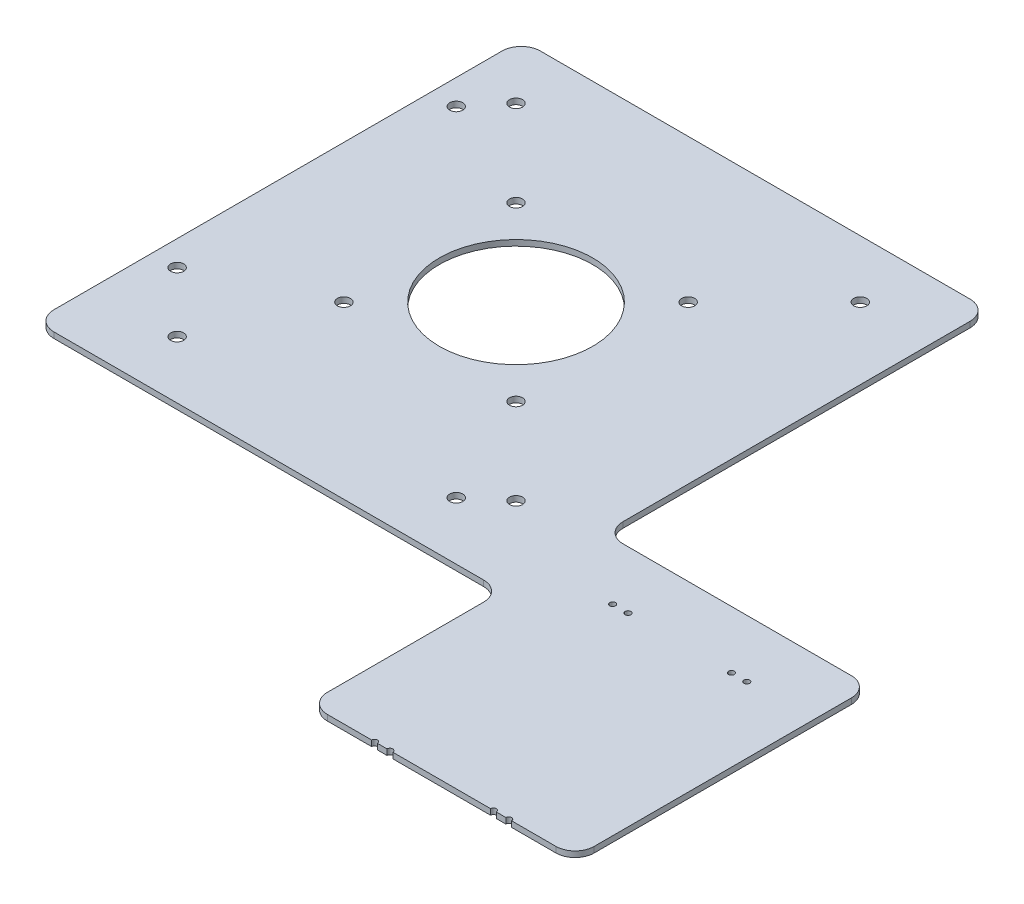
from build123d import *

# Parameters (mm, degrees)
ESQUISSE1_R      = 40
ESQUISSE1_R_2    = 3.4
ESQUISSE1_R_3    = 1.5
EXTRUSION1_DEPTH = 3


with BuildPart() as part:
    # Esquisse1 → Extrusion1 (new body)
    with BuildSketch(Plane(origin=(0, 0, 0), x_dir=(1, 0, 0), z_dir=(0, 1, 0))):
        with BuildLine():
            Line((117.1, 119.8), (-107.1, 119.8))
            ThreePointArc((-107.1, 119.8), (-114.171067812, 116.871067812), (-117.1, 109.8))
            Line((-117.1, 109.8), (-117.1, -124))
            ThreePointArc((-117.1, -124), (-114.171067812, -131.071067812), (-107.1, -134))
            Line((-107.1, -134), (117.1, -134))
            ThreePointArc((117.1, -134), (124.171067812, -136.928932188), (127.1, -144))
            Line((127.1, -144), (127.1, -225.5))
            ThreePointArc((127.1, -225.5), (130.028932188, -232.571067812), (137.1, -235.5))
            Line((137.1, -235.5), (160.2, -235.5))
            ThreePointArc((160.2, -235.5), (161.7, -234), (163.2, -235.5))
            Line((163.2, -235.5), (168.2, -235.5))
            ThreePointArc((168.2, -235.5), (169.7, -234), (171.2, -235.5))
            Line((171.2, -235.5), (222.2, -235.5))
            ThreePointArc((222.2, -235.5), (223.7, -234), (225.2, -235.5))
            Line((225.2, -235.5), (230.2, -235.5))
            ThreePointArc((230.2, -235.5), (231.7, -234), (233.2, -235.5))
            Line((233.2, -235.5), (256.3, -235.5))
            ThreePointArc((256.3, -235.5), (263.371067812, -232.571067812), (266.3, -225.5))
            Line((266.3, -225.5), (266.3, -91.3))
            ThreePointArc((266.3, -91.3), (263.371067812, -84.228932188), (256.3, -81.3))
            Line((256.3, -81.3), (137.1, -81.3))
            ThreePointArc((137.1, -81.3), (130.028932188, -78.371067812), (127.1, -71.3))
            Line((127.1, -71.3), (127.1, 109.8))
            ThreePointArc((127.1, 109.8), (124.171067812, 116.871067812), (117.1, 119.8))
        make_face()
        with Locations(Location((0, 0, 0), (0, 0, 270))):
            Circle(ESQUISSE1_R, mode=Mode.SUBTRACT)
        with Locations(Location((-104, 72.8, 0), (0, 0, 270))):
            Circle(ESQUISSE1_R_2, mode=Mode.SUBTRACT)
        with Locations(Location((-89.8, 89.8, 0), (0, 0, 270))):
            Circle(ESQUISSE1_R_2, mode=Mode.SUBTRACT)
        with Locations(Location((-44.9, 44.9, 0), (0, 0, 270))):
            Circle(ESQUISSE1_R_2, mode=Mode.SUBTRACT)
        with Locations(Location((44.9, 44.9, 0), (0, 0, 270))):
            Circle(ESQUISSE1_R_2, mode=Mode.SUBTRACT)
        with Locations(Location((44.9, -44.9, 0), (0, 0, 270))):
            Circle(ESQUISSE1_R_2, mode=Mode.SUBTRACT)
        with Locations(Location((-44.9, -44.9, 0), (0, 0, 270))):
            Circle(ESQUISSE1_R_2, mode=Mode.SUBTRACT)
        with Locations(Location((-104, -72.8, 0), (0, 0, 270))):
            Circle(ESQUISSE1_R_2, mode=Mode.SUBTRACT)
        with Locations(Location((-72.8, -104, 0), (0, 0, 270))):
            Circle(ESQUISSE1_R_2, mode=Mode.SUBTRACT)
        with Locations(Location((72.8, -104, 0), (0, 0, 270))):
            Circle(ESQUISSE1_R_2, mode=Mode.SUBTRACT)
        with Locations(Location((89.8, -89.8, 0), (0, 0, 270))):
            Circle(ESQUISSE1_R_2, mode=Mode.SUBTRACT)
        with Locations(Location((89.8, 89.8, 0), (0, 0, 270))):
            Circle(ESQUISSE1_R_2, mode=Mode.SUBTRACT)
        with Locations(Location((161.7, -111.3, 0), (0, 0, 270))):
            Circle(ESQUISSE1_R_3, mode=Mode.SUBTRACT)
        with Locations(Location((169.7, -111.3, 0), (0, 0, 270))):
            Circle(ESQUISSE1_R_3, mode=Mode.SUBTRACT)
        with Locations(Location((223.7, -111.3, 0), (0, 0, 270))):
            Circle(ESQUISSE1_R_3, mode=Mode.SUBTRACT)
        with Locations(Location((231.7, -111.3, 0), (0, 0, 270))):
            Circle(ESQUISSE1_R_3, mode=Mode.SUBTRACT)
    extrude(amount=EXTRUSION1_DEPTH)


solid = part.part
